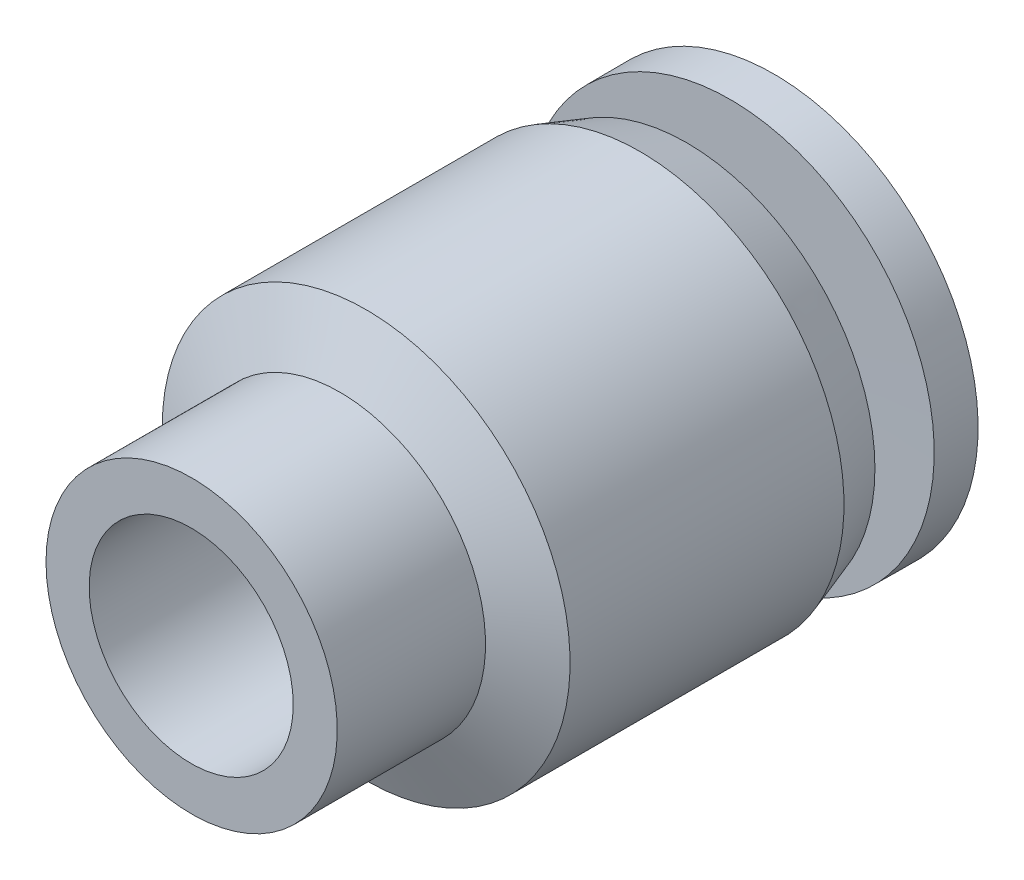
ISO-10303-21;
HEADER;
FILE_DESCRIPTION(('STEP AP214'),'2;1');
FILE_NAME('part.step','',(''),(''),'','','');
FILE_SCHEMA(('AUTOMOTIVE_DESIGN { 1 0 10303 214 1 1 1 1 }'));
ENDSEC;
DATA;
#1=APPLICATION_CONTEXT('core data for automotive mechanical design processes');
#2=APPLICATION_PROTOCOL_DEFINITION('international standard','automotive_design',2000,#1);
#3=PRODUCT_CONTEXT('',#1,'mechanical');
#4=PRODUCT('Part','Part','',(#3));
#5=PRODUCT_RELATED_PRODUCT_CATEGORY('part','',(#4));
#6=PRODUCT_DEFINITION_FORMATION('','',#4);
#7=PRODUCT_DEFINITION_CONTEXT('part definition',#1,'design');
#8=PRODUCT_DEFINITION('design','',#6,#7);
#9=PRODUCT_DEFINITION_SHAPE('','',#8);
#10=(LENGTH_UNIT() NAMED_UNIT(*) SI_UNIT(.MILLI.,.METRE.));
#11=(NAMED_UNIT(*) PLANE_ANGLE_UNIT() SI_UNIT($,.RADIAN.));
#12=(NAMED_UNIT(*) SI_UNIT($,.STERADIAN.) SOLID_ANGLE_UNIT());
#13=UNCERTAINTY_MEASURE_WITH_UNIT(LENGTH_MEASURE(1.E-05),#10,'distance_accuracy_value','');
#14=(GEOMETRIC_REPRESENTATION_CONTEXT(3) GLOBAL_UNCERTAINTY_ASSIGNED_CONTEXT((#13)) GLOBAL_UNIT_ASSIGNED_CONTEXT((#10,
#11,#12)) REPRESENTATION_CONTEXT('',''));
#15=CARTESIAN_POINT('',(0.,0.,0.));
#16=DIRECTION('',(0.,0.,1.));
#17=DIRECTION('',(1.,0.,0.));
#18=AXIS2_PLACEMENT_3D('',#15,#16,#17);
#19=CARTESIAN_POINT('',(0.,0.,-7.43269448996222));
#20=DIRECTION('',(0.,0.,1.));
#21=DIRECTION('',(1.,0.,0.));
#22=AXIS2_PLACEMENT_3D('',#19,#20,#21);
#23=CONICAL_SURFACE('',#22,6.99995756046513,1.56731414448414);
#24=CARTESIAN_POINT('',(0.,0.,-7.43269448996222));
#25=DIRECTION('',(0.,0.,-1.));
#26=DIRECTION('',(-1.,0.,0.));
#27=AXIS2_PLACEMENT_3D('',#24,#25,#26);
#28=CIRCLE('',#27,6.99995756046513);
#29=CARTESIAN_POINT('',(-6.99995756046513,0.,-7.43269448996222));
#30=VERTEX_POINT('',#29);
#31=EDGE_CURVE('E11',#30,#30,#28,.T.);
#32=ORIENTED_EDGE('',*,*,#31,.T.);
#33=EDGE_LOOP('',(#32));
#34=FACE_BOUND('',#33,.T.);
#35=CARTESIAN_POINT('',(-2.86255618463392,-2.03773335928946,-7.44483407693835));
#36=CARTESIAN_POINT('',(-2.97681850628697,-1.87775111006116,-7.44483297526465));
#37=CARTESIAN_POINT('',(-3.07765366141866,-1.70800284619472,-7.44483209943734));
#38=CARTESIAN_POINT('',(-3.24947399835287,-1.35384347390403,-7.44483082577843));
#39=CARTESIAN_POINT('',(-3.32042308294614,-1.16941495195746,-7.44483042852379));
#40=CARTESIAN_POINT('',(-3.43031673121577,-0.791334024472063,-7.44483012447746));
#41=CARTESIAN_POINT('',(-3.46927655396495,-0.597686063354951,-7.44483021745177));
#42=CARTESIAN_POINT('',(-3.51411979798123,-0.206650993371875,-7.44483089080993));
#43=CARTESIAN_POINT('',(-3.52001143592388,-0.00926482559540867,-7.44483147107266));
#44=CARTESIAN_POINT('',(-3.49857656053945,0.383717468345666,-7.44483310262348));
#45=CARTESIAN_POINT('',(-3.47124657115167,0.579313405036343,-7.44483415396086));
#46=CARTESIAN_POINT('',(-3.38413542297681,0.963148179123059,-7.44483669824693));
#47=CARTESIAN_POINT('',(-3.32435299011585,1.15138672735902,-7.44483819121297));
#48=CARTESIAN_POINT('',(-3.17403497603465,1.51515182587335,-7.44484157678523));
#49=CARTESIAN_POINT('',(-3.08349996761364,1.69067861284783,-7.44484346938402));
#50=CARTESIAN_POINT('',(-2.87424669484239,2.02404093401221,-7.44484760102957));
#51=CARTESIAN_POINT('',(-2.75552848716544,2.18187650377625,-7.44484984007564));
#52=CARTESIAN_POINT('',(-2.49327854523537,2.47537662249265,-7.4448546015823));
#53=CARTESIAN_POINT('',(-2.34974676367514,2.61104112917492,-7.44485712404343));
#54=CARTESIAN_POINT('',(-2.04194455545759,2.85634740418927,-7.44486238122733));
#55=CARTESIAN_POINT('',(-1.877674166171,2.96598921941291,-7.44486511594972));
#56=CARTESIAN_POINT('',(-1.53305762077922,3.15613806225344,-7.4448707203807));
#57=CARTESIAN_POINT('',(-1.35271145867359,3.23664507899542,-7.44487359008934));
#58=CARTESIAN_POINT('',(-0.981062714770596,3.36623897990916,-7.44487938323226));
#59=CARTESIAN_POINT('',(-0.789760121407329,3.41532583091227,-7.4448823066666));
#60=CARTESIAN_POINT('',(-0.401629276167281,3.48068582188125,-7.44488812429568));
#61=CARTESIAN_POINT('',(-0.204801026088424,3.49695897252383,-7.44489101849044));
#62=CARTESIAN_POINT('',(0.188793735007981,3.49622964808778,-7.44489669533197));
#63=CARTESIAN_POINT('',(0.385560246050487,3.47922718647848,-7.4448994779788));
#64=CARTESIAN_POINT('',(0.773446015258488,3.41242930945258,-7.44490485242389));
#65=CARTESIAN_POINT('',(0.964565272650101,3.36263388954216,-7.44490744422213));
#66=CARTESIAN_POINT('',(1.33573121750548,3.23166362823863,-7.44491236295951));
#67=CARTESIAN_POINT('',(1.51577790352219,3.15048878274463,-7.44491468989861));
#68=CARTESIAN_POINT('',(1.85968767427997,2.95906399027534,-7.44491901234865));
#69=CARTESIAN_POINT('',(2.02355075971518,2.84881404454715,-7.4449210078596));
#70=CARTESIAN_POINT('',(2.33044173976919,2.60236872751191,-7.44492461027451));
#71=CARTESIAN_POINT('',(2.47346963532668,2.46617335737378,-7.44492621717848));
#72=CARTESIAN_POINT('',(2.73463010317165,2.17170337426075,-7.44492899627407));
#73=CARTESIAN_POINT('',(2.85276267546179,2.01342876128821,-7.44493016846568));
#74=CARTESIAN_POINT('',(3.06077906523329,1.67929323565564,-7.44493204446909));
#75=CARTESIAN_POINT('',(3.15066288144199,1.5034323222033,-7.44493274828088));
#76=CARTESIAN_POINT('',(3.29963021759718,1.13911636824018,-7.44493366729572));
#77=CARTESIAN_POINT('',(3.3587137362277,0.950661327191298,-7.44493388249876));
#78=CARTESIAN_POINT('',(3.44440325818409,0.566506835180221,-7.44493381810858));
#79=CARTESIAN_POINT('',(3.47100926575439,0.370807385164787,-7.44493353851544));
#80=CARTESIAN_POINT('',(3.49098851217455,-0.0222805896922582,-7.44493249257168));
#81=CARTESIAN_POINT('',(3.48436175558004,-0.219669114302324,-7.44493172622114));
#82=CARTESIAN_POINT('',(3.43806358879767,-0.610532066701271,-7.44492972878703));
#83=CARTESIAN_POINT('',(3.39839216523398,-0.80400649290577,-7.44492849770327));
#84=CARTESIAN_POINT('',(3.28713078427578,-1.18154905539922,-7.44492560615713));
#85=CARTESIAN_POINT('',(3.21554081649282,-1.36561718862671,-7.4449239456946));
#86=CARTESIAN_POINT('',(3.04247466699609,-1.71912175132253,-7.44492024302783));
#87=CARTESIAN_POINT('',(2.94099851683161,-1.88855819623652,-7.44491820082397));
#88=CARTESIAN_POINT('',(2.71104062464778,-2.20798974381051,-7.44491379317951));
#89=CARTESIAN_POINT('',(2.58255889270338,-2.35798485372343,-7.44491142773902));
#90=CARTESIAN_POINT('',(2.30223677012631,-2.63427614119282,-7.44490644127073));
#91=CARTESIAN_POINT('',(2.15039633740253,-2.76057227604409,-7.44490382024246));
#92=CARTESIAN_POINT('',(1.82766760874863,-2.98587988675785,-7.44489839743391));
#93=CARTESIAN_POINT('',(1.65677934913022,-3.08489141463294,-7.44489559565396));
#94=CARTESIAN_POINT('',(1.30080535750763,-3.25281963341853,-7.44488989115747));
#95=CARTESIAN_POINT('',(1.11571959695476,-3.3217362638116,-7.44488698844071));
#96=CARTESIAN_POINT('',(0.736601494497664,-3.4275191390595,-7.44488116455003));
#97=CARTESIAN_POINT('',(0.542568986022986,-3.46438478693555,-7.44487824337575));
#98=CARTESIAN_POINT('',(0.151076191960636,-3.505015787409,-7.44487246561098));
#99=CARTESIAN_POINT('',(-0.0463839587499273,-3.5087824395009,-7.44486960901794));
#100=CARTESIAN_POINT('',(-0.439112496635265,-3.48311470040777,-7.4448640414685));
#101=CARTESIAN_POINT('',(-0.634381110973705,-3.45368378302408,-7.44486133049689));
#102=CARTESIAN_POINT('',(-1.01725820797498,-3.36244524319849,-7.44485612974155));
#103=CARTESIAN_POINT('',(-1.20486477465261,-3.30062957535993,-7.44485364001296));
#104=CARTESIAN_POINT('',(-1.56710901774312,-3.14635413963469,-7.44484895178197));
#105=CARTESIAN_POINT('',(-1.74174045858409,-3.05387975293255,-7.44484675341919));
#106=CARTESIAN_POINT('',(-2.07283617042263,-2.84097902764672,-7.44484271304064));
#107=CARTESIAN_POINT('',(-2.22932204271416,-2.72058644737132,-7.44484087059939));
#108=CARTESIAN_POINT('',(-2.46523427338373,-2.50519480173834,-7.44483820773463));
#109=CARTESIAN_POINT('',(-2.55154809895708,-2.41760985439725,-7.44483726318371));
#110=CARTESIAN_POINT('',(-2.71450778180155,-2.23386560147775,-7.44483554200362));
#111=CARTESIAN_POINT('',(-2.79115363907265,-2.13770629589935,-7.44483476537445));
#112=CARTESIAN_POINT('',(-2.86255618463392,-2.03773335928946,-7.44483407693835));
#113=B_SPLINE_CURVE_WITH_KNOTS('',3,(#35,#36,#37,#38,#39,#40,#41,#42,#43,#44,#45,#46,#47,#48,
#49,#50,#51,#52,#53,#54,#55,#56,#57,#58,#59,#60,#61,#62,#63,#64,#65,#66,#67,#68,#69,#70,#71,#72,
#73,#74,#75,#76,#77,#78,#79,#80,#81,#82,#83,#84,#85,#86,#87,#88,#89,#90,#91,#92,#93,#94,#95,#96,
#97,#98,#99,#100,#101,#102,#103,#104,#105,#106,#107,#108,#109,#110,#111,#112),.UNSPECIFIED.,.T.,
.F.,(4,2,2,2,2,2,2,2,2,2,2,2,2,2,2,2,2,2,2,2,2,2,2,2,2,2,2,2,2,2,2,2,2,2,2,2,2,2,4),(0.,
0.589341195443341,1.17939218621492,1.76916155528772,2.35878437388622,2.94846889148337,
3.5381765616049,4.12787324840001,4.71756874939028,5.30726537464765,5.89696093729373,
6.48665672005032,7.07635312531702,7.66604933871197,8.25574531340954,8.84544136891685,
9.43513750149,10.0248336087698,10.6145296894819,11.2042257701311,11.7939218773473,
12.3836180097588,12.9733140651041,13.5630100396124,14.1527062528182,14.7424026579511,
15.3320984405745,15.9217940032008,16.5114906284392,17.1011861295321,17.6908828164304,
18.2805904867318,18.8702750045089,19.4598978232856,20.0496671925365,20.6397181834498,
21.2290593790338,21.5973387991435,21.9656182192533),.UNSPECIFIED.);
#114=CARTESIAN_POINT('',(-2.86255618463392,-2.03773335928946,-7.44483407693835));
#115=VERTEX_POINT('',#114);
#116=EDGE_CURVE('E69',#115,#115,#113,.T.);
#117=ORIENTED_EDGE('',*,*,#116,.F.);
#118=EDGE_LOOP('',(#117));
#119=FACE_BOUND('',#118,.T.);
#120=ADVANCED_FACE('F34',(#34,#119),#23,.T.);
#121=CARTESIAN_POINT('',(0.,0.,-5.93270358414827));
#122=DIRECTION('',(0.,0.,-1.));
#123=DIRECTION('',(-1.,0.,0.));
#124=AXIS2_PLACEMENT_3D('',#121,#122,#123);
#125=CONICAL_SURFACE('',#124,6.99473429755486,0.00348218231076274);
#126=ORIENTED_EDGE('',*,*,#31,.F.);
#127=EDGE_LOOP('',(#126));
#128=FACE_BOUND('',#127,.T.);
#129=CARTESIAN_POINT('',(0.,0.,-5.93270358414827));
#130=DIRECTION('',(0.,0.,-1.));
#131=DIRECTION('',(-1.,0.,0.));
#132=AXIS2_PLACEMENT_3D('',#129,#130,#131);
#133=CIRCLE('',#132,6.99473429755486);
#134=CARTESIAN_POINT('',(-6.99473429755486,0.,-5.93270358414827));
#135=VERTEX_POINT('',#134);
#136=EDGE_CURVE('E41',#135,#135,#133,.T.);
#137=ORIENTED_EDGE('',*,*,#136,.T.);
#138=EDGE_LOOP('',(#137));
#139=FACE_BOUND('',#138,.T.);
#140=ADVANCED_FACE('F111',(#128,#139),#125,.T.);
#141=CARTESIAN_POINT('',(0.,0.,-5.94315010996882));
#142=DIRECTION('',(0.,0.,1.));
#143=DIRECTION('',(1.,0.,0.));
#144=AXIS2_PLACEMENT_3D('',#141,#142,#143);
#145=CONICAL_SURFACE('',#144,3.99475248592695,1.56731414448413);
#146=ORIENTED_EDGE('',*,*,#136,.F.);
#147=EDGE_LOOP('',(#146));
#148=FACE_BOUND('',#147,.T.);
#149=CARTESIAN_POINT('',(0.,0.,-5.94315010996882));
#150=DIRECTION('',(0.,0.,-1.));
#151=DIRECTION('',(-1.,0.,0.));
#152=AXIS2_PLACEMENT_3D('',#149,#150,#151);
#153=CIRCLE('',#152,3.99475248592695);
#154=CARTESIAN_POINT('',(-3.99475248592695,0.,-5.94315010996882));
#155=VERTEX_POINT('',#154);
#156=EDGE_CURVE('E45',#155,#155,#153,.T.);
#157=ORIENTED_EDGE('',*,*,#156,.T.);
#158=EDGE_LOOP('',(#157));
#159=FACE_BOUND('',#158,.T.);
#160=ADVANCED_FACE('F108',(#148,#159),#145,.F.);
#161=CARTESIAN_POINT('',(0.,0.,-7.45706971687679));
#162=DIRECTION('',(0.,0.,-1.));
#163=DIRECTION('',(-1.,0.,0.));
#164=AXIS2_PLACEMENT_3D('',#161,#162,#163);
#165=CYLINDRICAL_SURFACE('',#164,3.99475248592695);
#166=ORIENTED_EDGE('',*,*,#156,.F.);
#167=EDGE_LOOP('',(#166));
#168=FACE_BOUND('',#167,.T.);
#169=CARTESIAN_POINT('',(0.,0.,-4.44315010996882));
#170=DIRECTION('',(0.,0.,-1.));
#171=DIRECTION('',(-1.,0.,0.));
#172=AXIS2_PLACEMENT_3D('',#169,#170,#171);
#173=CIRCLE('',#172,3.99475248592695);
#174=CARTESIAN_POINT('',(-3.99475248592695,0.,-4.44315010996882));
#175=VERTEX_POINT('',#174);
#176=EDGE_CURVE('E49',#175,#175,#173,.T.);
#177=ORIENTED_EDGE('',*,*,#176,.T.);
#178=EDGE_LOOP('',(#177));
#179=FACE_BOUND('',#178,.T.);
#180=ADVANCED_FACE('F104',(#168,#179),#165,.T.);
#181=CARTESIAN_POINT('',(3.99475248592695,0.,-4.44315010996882));
#182=DIRECTION('',(0.,0.,1.));
#183=DIRECTION('',(1.,0.,0.));
#184=AXIS2_PLACEMENT_3D('',#181,#182,#183);
#185=PLANE('',#184);
#186=ORIENTED_EDGE('',*,*,#176,.F.);
#187=EDGE_LOOP('',(#186));
#188=FACE_BOUND('',#187,.T.);
#189=CARTESIAN_POINT('',(0.,0.,-4.44315010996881));
#190=DIRECTION('',(0.,0.,-1.));
#191=DIRECTION('',(-1.,0.,0.));
#192=AXIS2_PLACEMENT_3D('',#189,#190,#191);
#193=CIRCLE('',#192,6.45134909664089);
#194=CARTESIAN_POINT('',(-6.45134909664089,0.,-4.44315010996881));
#195=VERTEX_POINT('',#194);
#196=EDGE_CURVE('E54',#195,#195,#193,.T.);
#197=ORIENTED_EDGE('',*,*,#196,.T.);
#198=EDGE_LOOP('',(#197));
#199=FACE_BOUND('',#198,.T.);
#200=ADVANCED_FACE('F100',(#188,#199),#185,.F.);
#201=CARTESIAN_POINT('',(0.,0.,-2.83862904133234));
#202=DIRECTION('',(0.,0.,1.));
#203=DIRECTION('',(1.,0.,0.));
#204=AXIS2_PLACEMENT_3D('',#201,#202,#203);
#205=CONICAL_SURFACE('',#204,6.99473429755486,0.326535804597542);
#206=ORIENTED_EDGE('',*,*,#196,.F.);
#207=EDGE_LOOP('',(#206));
#208=FACE_BOUND('',#207,.T.);
#209=CARTESIAN_POINT('',(0.,0.,-2.83862904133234));
#210=DIRECTION('',(0.,0.,-1.));
#211=DIRECTION('',(-1.,0.,0.));
#212=AXIS2_PLACEMENT_3D('',#209,#210,#211);
#213=CIRCLE('',#212,6.99473429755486);
#214=CARTESIAN_POINT('',(-6.99473429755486,0.,-2.83862904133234));
#215=VERTEX_POINT('',#214);
#216=EDGE_CURVE('E57',#215,#215,#213,.T.);
#217=ORIENTED_EDGE('',*,*,#216,.T.);
#218=EDGE_LOOP('',(#217));
#219=FACE_BOUND('',#218,.T.);
#220=ADVANCED_FACE('F96',(#208,#219),#205,.T.);
#221=CARTESIAN_POINT('',(0.,0.,-7.45706971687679));
#222=DIRECTION('',(0.,0.,-1.));
#223=DIRECTION('',(-1.,0.,0.));
#224=AXIS2_PLACEMENT_3D('',#221,#222,#223);
#225=CYLINDRICAL_SURFACE('',#224,6.99473429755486);
#226=ORIENTED_EDGE('',*,*,#216,.F.);
#227=EDGE_LOOP('',(#226));
#228=FACE_BOUND('',#227,.T.);
#229=CARTESIAN_POINT('',(0.,0.,6.55684989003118));
#230=DIRECTION('',(0.,0.,-1.));
#231=DIRECTION('',(-1.,0.,0.));
#232=AXIS2_PLACEMENT_3D('',#229,#230,#231);
#233=CIRCLE('',#232,6.99473429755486);
#234=CARTESIAN_POINT('',(-6.99473429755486,0.,6.55684989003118));
#235=VERTEX_POINT('',#234);
#236=EDGE_CURVE('E60',#235,#235,#233,.T.);
#237=ORIENTED_EDGE('',*,*,#236,.T.);
#238=EDGE_LOOP('',(#237));
#239=FACE_BOUND('',#238,.T.);
#240=ADVANCED_FACE('F92',(#228,#239),#225,.T.);
#241=CARTESIAN_POINT('',(0.,0.,7.45684989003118));
#242=DIRECTION('',(0.,0.,-1.));
#243=DIRECTION('',(-1.,0.,0.));
#244=AXIS2_PLACEMENT_3D('',#241,#242,#243);
#245=CONICAL_SURFACE('',#244,4.99473429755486,1.14794240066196);
#246=ORIENTED_EDGE('',*,*,#236,.F.);
#247=EDGE_LOOP('',(#246));
#248=FACE_BOUND('',#247,.T.);
#249=CARTESIAN_POINT('',(0.,0.,7.45684989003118));
#250=DIRECTION('',(0.,0.,-1.));
#251=DIRECTION('',(-1.,0.,0.));
#252=AXIS2_PLACEMENT_3D('',#249,#250,#251);
#253=CIRCLE('',#252,4.99473429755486);
#254=CARTESIAN_POINT('',(-4.99473429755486,0.,7.45684989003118));
#255=VERTEX_POINT('',#254);
#256=EDGE_CURVE('E63',#255,#255,#253,.T.);
#257=ORIENTED_EDGE('',*,*,#256,.T.);
#258=EDGE_LOOP('',(#257));
#259=FACE_BOUND('',#258,.T.);
#260=ADVANCED_FACE('F88',(#248,#259),#245,.T.);
#261=CARTESIAN_POINT('',(0.,0.,-7.45706971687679));
#262=DIRECTION('',(0.,0.,-1.));
#263=DIRECTION('',(-1.,0.,0.));
#264=AXIS2_PLACEMENT_3D('',#261,#262,#263);
#265=CYLINDRICAL_SURFACE('',#264,4.99473429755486);
#266=ORIENTED_EDGE('',*,*,#256,.F.);
#267=EDGE_LOOP('',(#266));
#268=FACE_BOUND('',#267,.T.);
#269=CARTESIAN_POINT('',(0.,0.,12.5429302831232));
#270=DIRECTION('',(0.,0.,-1.));
#271=DIRECTION('',(-1.,0.,0.));
#272=AXIS2_PLACEMENT_3D('',#269,#270,#271);
#273=CIRCLE('',#272,4.99473429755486);
#274=CARTESIAN_POINT('',(-4.99473429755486,0.,12.5429302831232));
#275=VERTEX_POINT('',#274);
#276=EDGE_CURVE('E66',#275,#275,#273,.T.);
#277=ORIENTED_EDGE('',*,*,#276,.T.);
#278=EDGE_LOOP('',(#277));
#279=FACE_BOUND('',#278,.T.);
#280=ADVANCED_FACE('F84',(#268,#279),#265,.T.);
#281=CARTESIAN_POINT('',(4.99473429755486,0.,12.5429302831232));
#282=DIRECTION('',(0.,0.,-1.));
#283=DIRECTION('',(-1.,0.,0.));
#284=AXIS2_PLACEMENT_3D('',#281,#282,#283);
#285=PLANE('',#284);
#286=CARTESIAN_POINT('',(-0.0144890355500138,-0.00339968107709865,12.5429302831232));
#287=DIRECTION('',(0.,0.,1.));
#288=DIRECTION('',(1.,0.,0.));
#289=AXIS2_PLACEMENT_3D('',#286,#287,#288);
#290=CIRCLE('',#289,3.5);
#291=CARTESIAN_POINT('',(3.48551096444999,-0.00339968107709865,12.5429302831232));
#292=VERTEX_POINT('',#291);
#293=EDGE_CURVE('E75',#292,#292,#290,.T.);
#294=ORIENTED_EDGE('',*,*,#293,.F.);
#295=EDGE_LOOP('',(#294));
#296=FACE_BOUND('',#295,.T.);
#297=ORIENTED_EDGE('',*,*,#276,.F.);
#298=EDGE_LOOP('',(#297));
#299=FACE_BOUND('',#298,.T.);
#300=ADVANCED_FACE('F80',(#296,#299),#285,.F.);
#301=CARTESIAN_POINT('',(-0.0144890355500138,-0.00339968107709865,12.5429302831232));
#302=DIRECTION('',(0.,0.,-1.));
#303=DIRECTION('',(-1.,0.,0.));
#304=AXIS2_PLACEMENT_3D('',#301,#302,#303);
#305=CYLINDRICAL_SURFACE('',#304,3.5);
#306=ORIENTED_EDGE('',*,*,#293,.T.);
#307=EDGE_LOOP('',(#306));
#308=FACE_BOUND('',#307,.T.);
#309=ORIENTED_EDGE('',*,*,#116,.T.);
#310=EDGE_LOOP('',(#309));
#311=FACE_BOUND('',#310,.T.);
#312=ADVANCED_FACE('F76',(#308,#311),#305,.F.);
#313=CLOSED_SHELL('',(#120,#140,#160,#180,#200,#220,#240,#260,#280,#300,#312));
#314=MANIFOLD_SOLID_BREP('B2',#313);
#315=ADVANCED_BREP_SHAPE_REPRESENTATION('',(#18,#314),#14);
#316=SHAPE_DEFINITION_REPRESENTATION(#9,#315);
ENDSEC;
END-ISO-10303-21;
